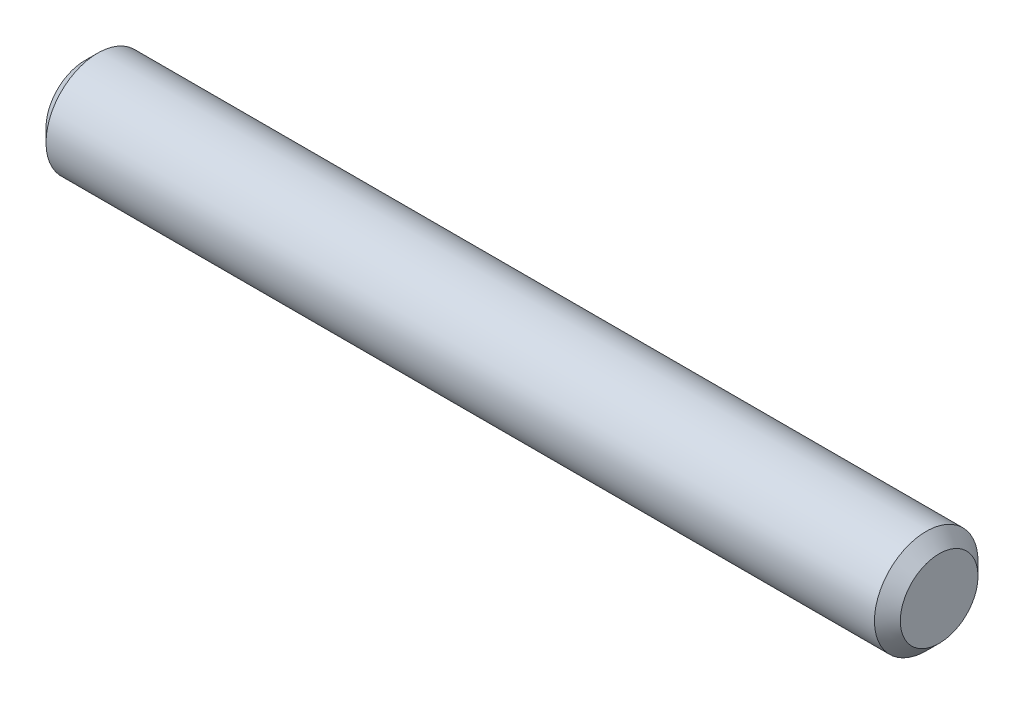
ISO-10303-21;
HEADER;
FILE_DESCRIPTION(('STEP AP214'),'2;1');
FILE_NAME('part.step','',(''),(''),'','','');
FILE_SCHEMA(('AUTOMOTIVE_DESIGN { 1 0 10303 214 1 1 1 1 }'));
ENDSEC;
DATA;
#1=APPLICATION_CONTEXT('core data for automotive mechanical design processes');
#2=APPLICATION_PROTOCOL_DEFINITION('international standard','automotive_design',2000,#1);
#3=PRODUCT_CONTEXT('',#1,'mechanical');
#4=PRODUCT('Part','Part','',(#3));
#5=PRODUCT_RELATED_PRODUCT_CATEGORY('part','',(#4));
#6=PRODUCT_DEFINITION_FORMATION('','',#4);
#7=PRODUCT_DEFINITION_CONTEXT('part definition',#1,'design');
#8=PRODUCT_DEFINITION('design','',#6,#7);
#9=PRODUCT_DEFINITION_SHAPE('','',#8);
#10=(LENGTH_UNIT() NAMED_UNIT(*) SI_UNIT(.MILLI.,.METRE.));
#11=(NAMED_UNIT(*) PLANE_ANGLE_UNIT() SI_UNIT($,.RADIAN.));
#12=(NAMED_UNIT(*) SI_UNIT($,.STERADIAN.) SOLID_ANGLE_UNIT());
#13=UNCERTAINTY_MEASURE_WITH_UNIT(LENGTH_MEASURE(1.E-05),#10,'distance_accuracy_value','');
#14=(GEOMETRIC_REPRESENTATION_CONTEXT(3) GLOBAL_UNCERTAINTY_ASSIGNED_CONTEXT((#13)) GLOBAL_UNIT_ASSIGNED_CONTEXT((#10,
#11,#12)) REPRESENTATION_CONTEXT('',''));
#15=CARTESIAN_POINT('',(0.,0.,0.));
#16=DIRECTION('',(0.,0.,1.));
#17=DIRECTION('',(1.,0.,0.));
#18=AXIS2_PLACEMENT_3D('',#15,#16,#17);
#19=CARTESIAN_POINT('',(0.,0.,0.));
#20=DIRECTION('',(-1.,0.,0.));
#21=DIRECTION('',(0.,0.,1.));
#22=AXIS2_PLACEMENT_3D('',#19,#20,#21);
#23=PLANE('',#22);
#24=CARTESIAN_POINT('',(0.,0.,0.));
#25=DIRECTION('',(-1.,0.,0.));
#26=DIRECTION('',(0.,0.,1.));
#27=AXIS2_PLACEMENT_3D('',#24,#25,#26);
#28=CIRCLE('',#27,3.);
#29=CARTESIAN_POINT('',(0.,0.,3.));
#30=VERTEX_POINT('',#29);
#31=EDGE_CURVE('E10',#30,#30,#28,.T.);
#32=ORIENTED_EDGE('',*,*,#31,.T.);
#33=EDGE_LOOP('',(#32));
#34=FACE_BOUND('',#33,.T.);
#35=ADVANCED_FACE('F32',(#34),#23,.T.);
#36=CARTESIAN_POINT('',(0.,0.,0.));
#37=DIRECTION('',(1.,0.,0.));
#38=DIRECTION('',(0.,0.,-1.));
#39=AXIS2_PLACEMENT_3D('',#36,#37,#38);
#40=CONICAL_SURFACE('',#39,3.,0.785398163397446);
#41=CARTESIAN_POINT('',(1.,0.,0.));
#42=DIRECTION('',(-1.,0.,0.));
#43=DIRECTION('',(0.,0.,1.));
#44=AXIS2_PLACEMENT_3D('',#41,#42,#43);
#45=CIRCLE('',#44,4.);
#46=CARTESIAN_POINT('',(1.,0.,4.));
#47=VERTEX_POINT('',#46);
#48=EDGE_CURVE('E38',#47,#47,#45,.T.);
#49=ORIENTED_EDGE('',*,*,#48,.T.);
#50=EDGE_LOOP('',(#49));
#51=FACE_BOUND('',#50,.T.);
#52=ORIENTED_EDGE('',*,*,#31,.F.);
#53=EDGE_LOOP('',(#52));
#54=FACE_BOUND('',#53,.T.);
#55=ADVANCED_FACE('F64',(#51,#54),#40,.T.);
#56=CARTESIAN_POINT('',(-3.,0.,0.));
#57=DIRECTION('',(-1.,0.,0.));
#58=DIRECTION('',(0.,0.,1.));
#59=AXIS2_PLACEMENT_3D('',#56,#57,#58);
#60=CYLINDRICAL_SURFACE('',#59,4.);
#61=CARTESIAN_POINT('',(65.0000000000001,0.,0.));
#62=DIRECTION('',(-1.,0.,0.));
#63=DIRECTION('',(0.,0.,1.));
#64=AXIS2_PLACEMENT_3D('',#61,#62,#63);
#65=CIRCLE('',#64,4.);
#66=CARTESIAN_POINT('',(65.0000000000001,0.,4.));
#67=VERTEX_POINT('',#66);
#68=EDGE_CURVE('E42',#67,#67,#65,.T.);
#69=ORIENTED_EDGE('',*,*,#68,.T.);
#70=EDGE_LOOP('',(#69));
#71=FACE_BOUND('',#70,.T.);
#72=ORIENTED_EDGE('',*,*,#48,.F.);
#73=EDGE_LOOP('',(#72));
#74=FACE_BOUND('',#73,.T.);
#75=ADVANCED_FACE('F61',(#71,#74),#60,.T.);
#76=CARTESIAN_POINT('',(65.0000000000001,0.,0.));
#77=DIRECTION('',(-1.,0.,0.));
#78=DIRECTION('',(0.,0.,1.));
#79=AXIS2_PLACEMENT_3D('',#76,#77,#78);
#80=CONICAL_SURFACE('',#79,4.,0.785398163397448);
#81=CARTESIAN_POINT('',(66.0000000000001,0.,0.));
#82=DIRECTION('',(-1.,0.,0.));
#83=DIRECTION('',(0.,0.,1.));
#84=AXIS2_PLACEMENT_3D('',#81,#82,#83);
#85=CIRCLE('',#84,3.);
#86=CARTESIAN_POINT('',(66.0000000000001,0.,3.));
#87=VERTEX_POINT('',#86);
#88=EDGE_CURVE('E46',#87,#87,#85,.T.);
#89=ORIENTED_EDGE('',*,*,#88,.T.);
#90=EDGE_LOOP('',(#89));
#91=FACE_BOUND('',#90,.T.);
#92=ORIENTED_EDGE('',*,*,#68,.F.);
#93=EDGE_LOOP('',(#92));
#94=FACE_BOUND('',#93,.T.);
#95=ADVANCED_FACE('F52',(#91,#94),#80,.T.);
#96=CARTESIAN_POINT('',(66.0000000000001,3.,0.));
#97=DIRECTION('',(1.,0.,0.));
#98=DIRECTION('',(0.,0.,-1.));
#99=AXIS2_PLACEMENT_3D('',#96,#97,#98);
#100=PLANE('',#99);
#101=ORIENTED_EDGE('',*,*,#88,.F.);
#102=EDGE_LOOP('',(#101));
#103=FACE_BOUND('',#102,.T.);
#104=ADVANCED_FACE('F55',(#103),#100,.T.);
#105=CLOSED_SHELL('',(#35,#55,#75,#95,#104));
#106=MANIFOLD_SOLID_BREP('B2',#105);
#107=ADVANCED_BREP_SHAPE_REPRESENTATION('',(#18,#106),#14);
#108=SHAPE_DEFINITION_REPRESENTATION(#9,#107);
ENDSEC;
END-ISO-10303-21;
